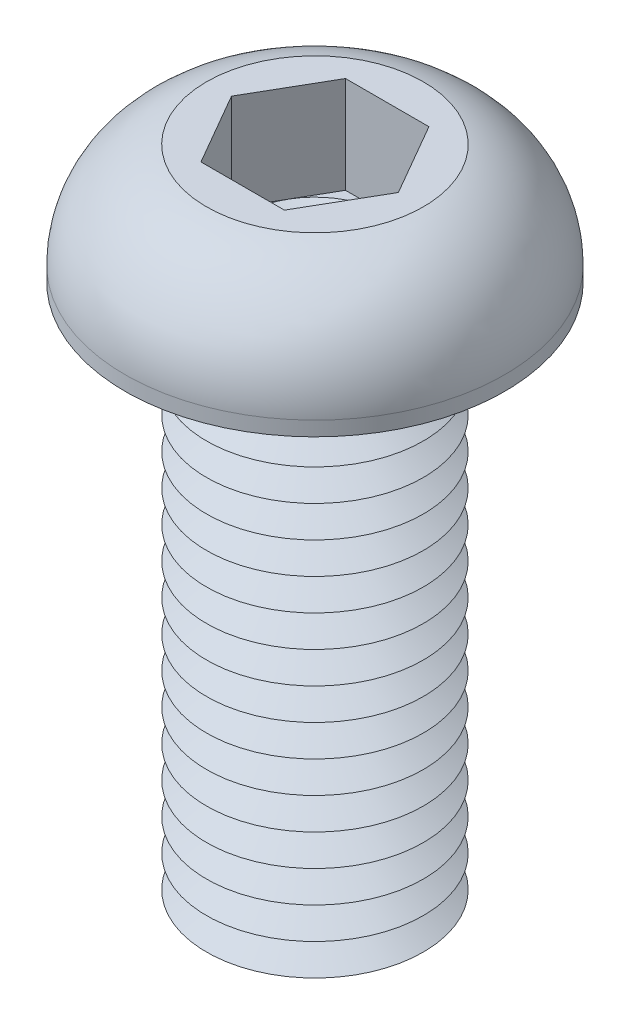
ISO-10303-21;
HEADER;
FILE_DESCRIPTION(('STEP AP214'),'2;1');
FILE_NAME('part.step','',(''),(''),'','','');
FILE_SCHEMA(('AUTOMOTIVE_DESIGN { 1 0 10303 214 1 1 1 1 }'));
ENDSEC;
DATA;
#1=APPLICATION_CONTEXT('core data for automotive mechanical design processes');
#2=APPLICATION_PROTOCOL_DEFINITION('international standard','automotive_design',2000,#1);
#3=PRODUCT_CONTEXT('',#1,'mechanical');
#4=PRODUCT('Part','Part','',(#3));
#5=PRODUCT_RELATED_PRODUCT_CATEGORY('part','',(#4));
#6=PRODUCT_DEFINITION_FORMATION('','',#4);
#7=PRODUCT_DEFINITION_CONTEXT('part definition',#1,'design');
#8=PRODUCT_DEFINITION('design','',#6,#7);
#9=PRODUCT_DEFINITION_SHAPE('','',#8);
#10=(LENGTH_UNIT() NAMED_UNIT(*) SI_UNIT(.MILLI.,.METRE.));
#11=(NAMED_UNIT(*) PLANE_ANGLE_UNIT() SI_UNIT($,.RADIAN.));
#12=(NAMED_UNIT(*) SI_UNIT($,.STERADIAN.) SOLID_ANGLE_UNIT());
#13=UNCERTAINTY_MEASURE_WITH_UNIT(LENGTH_MEASURE(1.E-05),#10,'distance_accuracy_value','');
#14=(GEOMETRIC_REPRESENTATION_CONTEXT(3) GLOBAL_UNCERTAINTY_ASSIGNED_CONTEXT((#13)) GLOBAL_UNIT_ASSIGNED_CONTEXT((#10,
#11,#12)) REPRESENTATION_CONTEXT('',''));
#15=CARTESIAN_POINT('',(0.,0.,0.));
#16=DIRECTION('',(0.,0.,1.));
#17=DIRECTION('',(1.,0.,0.));
#18=AXIS2_PLACEMENT_3D('',#15,#16,#17);
#19=CARTESIAN_POINT('',(0.,0.,0.));
#20=DIRECTION('',(0.,-1.,0.));
#21=DIRECTION('',(0.,0.,-1.));
#22=AXIS2_PLACEMENT_3D('',#19,#20,#21);
#23=TOROIDAL_SURFACE('',#22,6.875,0.875);
#24=CARTESIAN_POINT('',(0.,0.,-7.75));
#25=VERTEX_POINT('',#24);
#26=VERTEX_LOOP('',#25);
#27=FACE_BOUND('',#26,.T.);
#28=ADVANCED_FACE('P0_F12',(#27),#23,.T.);
#29=CLOSED_SHELL('',(#28));
#30=MANIFOLD_SOLID_BREP('P0_B1',#29);
#31=CARTESIAN_POINT('',(2.3094010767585,1.24,-4.));
#32=DIRECTION('',(0.,1.,0.));
#33=DIRECTION('',(0.,0.,1.));
#34=AXIS2_PLACEMENT_3D('',#31,#32,#33);
#35=PLANE('',#34);
#36=CARTESIAN_POINT('',(0.,1.24,0.));
#37=DIRECTION('',(0.,1.,0.));
#38=DIRECTION('',(0.,0.,1.));
#39=AXIS2_PLACEMENT_3D('',#36,#37,#38);
#40=CIRCLE('',#39,4.);
#41=CARTESIAN_POINT('',(0.,1.24,4.));
#42=VERTEX_POINT('',#41);
#43=CARTESIAN_POINT('',(3.46410161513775,1.24,2.));
#44=VERTEX_POINT('',#43);
#45=EDGE_CURVE('P1_E93',#42,#44,#40,.T.);
#46=ORIENTED_EDGE('',*,*,#45,.F.);
#47=DIRECTION('',(1.,0.,0.));
#48=VECTOR('',#47,1.);
#49=CARTESIAN_POINT('',(-2.3094010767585,1.24,4.));
#50=LINE('',#49,#48);
#51=CARTESIAN_POINT('',(2.3094010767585,1.24,4.));
#52=VERTEX_POINT('',#51);
#53=EDGE_CURVE('P1_E116',#42,#52,#50,.T.);
#54=ORIENTED_EDGE('',*,*,#53,.T.);
#55=DIRECTION('',(0.5,0.,-0.866025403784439));
#56=VECTOR('',#55,1.);
#57=CARTESIAN_POINT('',(2.3094010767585,1.24,4.));
#58=LINE('',#57,#56);
#59=EDGE_CURVE('P1_E112',#52,#44,#58,.T.);
#60=ORIENTED_EDGE('',*,*,#59,.T.);
#61=EDGE_LOOP('',(#46,#54,#60));
#62=FACE_BOUND('',#61,.T.);
#63=ADVANCED_FACE('P1_F15',(#62),#35,.T.);
#64=CARTESIAN_POINT('',(0.,1.24,0.));
#65=DIRECTION('',(0.,1.,0.));
#66=DIRECTION('',(0.,0.,1.));
#67=AXIS2_PLACEMENT_3D('',#64,#65,#66);
#68=CIRCLE('',#67,4.);
#69=CARTESIAN_POINT('',(3.46410161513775,1.24,-2.));
#70=VERTEX_POINT('',#69);
#71=EDGE_CURVE('P1_E10',#44,#70,#68,.T.);
#72=ORIENTED_EDGE('',*,*,#71,.F.);
#73=CARTESIAN_POINT('',(4.61880215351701,1.24,0.));
#74=VERTEX_POINT('',#73);
#75=EDGE_CURVE('P1_E104',#44,#74,#58,.T.);
#76=ORIENTED_EDGE('',*,*,#75,.T.);
#77=DIRECTION('',(-0.5,0.,-0.866025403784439));
#78=VECTOR('',#77,1.);
#79=CARTESIAN_POINT('',(4.61880215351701,1.24,0.));
#80=LINE('',#79,#78);
#81=EDGE_CURVE('P1_E107',#74,#70,#80,.T.);
#82=ORIENTED_EDGE('',*,*,#81,.T.);
#83=EDGE_LOOP('',(#72,#76,#82));
#84=FACE_BOUND('',#83,.T.);
#85=ADVANCED_FACE('P1_F103',(#84),#35,.T.);
#86=CARTESIAN_POINT('',(0.,1.24,-4.));
#87=VERTEX_POINT('',#86);
#88=EDGE_CURVE('P1_E24',#70,#87,#68,.T.);
#89=ORIENTED_EDGE('',*,*,#88,.F.);
#90=CARTESIAN_POINT('',(2.3094010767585,1.24,-4.));
#91=VERTEX_POINT('',#90);
#92=EDGE_CURVE('P1_E139',#70,#91,#80,.T.);
#93=ORIENTED_EDGE('',*,*,#92,.T.);
#94=DIRECTION('',(-1.,0.,0.));
#95=VECTOR('',#94,1.);
#96=CARTESIAN_POINT('',(2.3094010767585,1.24,-4.));
#97=LINE('',#96,#95);
#98=EDGE_CURVE('P1_E318',#91,#87,#97,.T.);
#99=ORIENTED_EDGE('',*,*,#98,.T.);
#100=EDGE_LOOP('',(#89,#93,#99));
#101=FACE_BOUND('',#100,.T.);
#102=ADVANCED_FACE('P1_F283',(#101),#35,.T.);
#103=CARTESIAN_POINT('',(-3.46410161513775,1.24,-2.));
#104=VERTEX_POINT('',#103);
#105=EDGE_CURVE('P1_E313',#87,#104,#68,.T.);
#106=ORIENTED_EDGE('',*,*,#105,.F.);
#107=CARTESIAN_POINT('',(-2.3094010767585,1.24,-4.));
#108=VERTEX_POINT('',#107);
#109=EDGE_CURVE('P1_E322',#87,#108,#97,.T.);
#110=ORIENTED_EDGE('',*,*,#109,.T.);
#111=DIRECTION('',(-0.5,0.,0.866025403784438));
#112=VECTOR('',#111,1.);
#113=CARTESIAN_POINT('',(-2.3094010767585,1.24,-4.));
#114=LINE('',#113,#112);
#115=EDGE_CURVE('P1_E317',#108,#104,#114,.T.);
#116=ORIENTED_EDGE('',*,*,#115,.T.);
#117=EDGE_LOOP('',(#106,#110,#116));
#118=FACE_BOUND('',#117,.T.);
#119=ADVANCED_FACE('P1_F297',(#118),#35,.T.);
#120=CARTESIAN_POINT('',(-3.46410161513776,1.24,2.));
#121=VERTEX_POINT('',#120);
#122=EDGE_CURVE('P1_E31',#104,#121,#68,.T.);
#123=ORIENTED_EDGE('',*,*,#122,.F.);
#124=CARTESIAN_POINT('',(-4.61880215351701,1.24,0.));
#125=VERTEX_POINT('',#124);
#126=EDGE_CURVE('P1_E309',#104,#125,#114,.T.);
#127=ORIENTED_EDGE('',*,*,#126,.T.);
#128=DIRECTION('',(0.5,0.,0.866025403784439));
#129=VECTOR('',#128,1.);
#130=CARTESIAN_POINT('',(-4.61880215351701,1.24,0.));
#131=LINE('',#130,#129);
#132=EDGE_CURVE('P1_E312',#125,#121,#131,.T.);
#133=ORIENTED_EDGE('',*,*,#132,.T.);
#134=EDGE_LOOP('',(#123,#127,#133));
#135=FACE_BOUND('',#134,.T.);
#136=ADVANCED_FACE('P1_F288',(#135),#35,.T.);
#137=CARTESIAN_POINT('',(0.,-28.25,0.));
#138=DIRECTION('',(0.,1.,0.));
#139=DIRECTION('',(0.,0.,1.));
#140=AXIS2_PLACEMENT_3D('',#137,#138,#139);
#141=CONICAL_SURFACE('',#140,4.48445554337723,1.0471975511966);
#142=CARTESIAN_POINT('',(0.,-27.375,0.));
#143=DIRECTION('',(0.,-1.,0.));
#144=DIRECTION('',(0.,0.,-1.));
#145=AXIS2_PLACEMENT_3D('',#142,#143,#144);
#146=CIRCLE('',#145,6.);
#147=CARTESIAN_POINT('',(0.,-27.375,-6.));
#148=VERTEX_POINT('',#147);
#149=EDGE_CURVE('P1_E245',#148,#148,#146,.T.);
#150=ORIENTED_EDGE('',*,*,#149,.T.);
#151=EDGE_LOOP('',(#150));
#152=FACE_BOUND('',#151,.T.);
#153=CARTESIAN_POINT('',(0.,-28.25,0.));
#154=DIRECTION('',(0.,-1.,0.));
#155=DIRECTION('',(0.,0.,-1.));
#156=AXIS2_PLACEMENT_3D('',#153,#154,#155);
#157=CIRCLE('',#156,4.48445554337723);
#158=CARTESIAN_POINT('',(0.,-28.25,-4.48445554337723));
#159=VERTEX_POINT('',#158);
#160=EDGE_CURVE('P1_E248',#159,#159,#157,.T.);
#161=ORIENTED_EDGE('',*,*,#160,.F.);
#162=EDGE_LOOP('',(#161));
#163=FACE_BOUND('',#162,.T.);
#164=ADVANCED_FACE('P1_F296',(#152,#163),#141,.T.);
#165=CARTESIAN_POINT('',(0.,-29.125,0.));
#166=DIRECTION('',(0.,-1.,0.));
#167=DIRECTION('',(0.,0.,-1.));
#168=AXIS2_PLACEMENT_3D('',#165,#166,#167);
#169=CONICAL_SURFACE('',#168,6.,1.0471975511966);
#170=ORIENTED_EDGE('',*,*,#160,.T.);
#171=EDGE_LOOP('',(#170));
#172=FACE_BOUND('',#171,.T.);
#173=CARTESIAN_POINT('',(0.,-29.125,0.));
#174=DIRECTION('',(0.,-1.,0.));
#175=DIRECTION('',(0.,0.,-1.));
#176=AXIS2_PLACEMENT_3D('',#173,#174,#175);
#177=CIRCLE('',#176,6.);
#178=CARTESIAN_POINT('',(0.,-29.125,-6.));
#179=VERTEX_POINT('',#178);
#180=EDGE_CURVE('P1_E251',#179,#179,#177,.T.);
#181=ORIENTED_EDGE('',*,*,#180,.F.);
#182=EDGE_LOOP('',(#181));
#183=FACE_BOUND('',#182,.T.);
#184=ADVANCED_FACE('P1_F303',(#172,#183),#169,.T.);
#185=CARTESIAN_POINT('',(0.,-30.,0.));
#186=DIRECTION('',(0.,1.,0.));
#187=DIRECTION('',(0.,0.,1.));
#188=AXIS2_PLACEMENT_3D('',#185,#186,#187);
#189=PLANE('',#188);
#190=CARTESIAN_POINT('',(0.,-30.,0.));
#191=DIRECTION('',(0.,-1.,0.));
#192=DIRECTION('',(0.,0.,-1.));
#193=AXIS2_PLACEMENT_3D('',#190,#191,#192);
#194=CIRCLE('',#193,4.48445554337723);
#195=CARTESIAN_POINT('',(0.,-30.,-4.48445554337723));
#196=VERTEX_POINT('',#195);
#197=EDGE_CURVE('P1_E254',#196,#196,#194,.T.);
#198=ORIENTED_EDGE('',*,*,#197,.T.);
#199=EDGE_LOOP('',(#198));
#200=FACE_BOUND('',#199,.T.);
#201=ADVANCED_FACE('P1_F381',(#200),#189,.F.);
#202=CARTESIAN_POINT('',(0.,-30.,0.));
#203=DIRECTION('',(0.,1.,0.));
#204=DIRECTION('',(0.,0.,1.));
#205=AXIS2_PLACEMENT_3D('',#202,#203,#204);
#206=CONICAL_SURFACE('',#205,4.48445554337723,1.0471975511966);
#207=ORIENTED_EDGE('',*,*,#180,.T.);
#208=EDGE_LOOP('',(#207));
#209=FACE_BOUND('',#208,.T.);
#210=ORIENTED_EDGE('',*,*,#197,.F.);
#211=EDGE_LOOP('',(#210));
#212=FACE_BOUND('',#211,.T.);
#213=ADVANCED_FACE('P1_F392',(#209,#212),#206,.T.);
#214=CARTESIAN_POINT('',(0.,-26.5,0.));
#215=DIRECTION('',(0.,1.,0.));
#216=DIRECTION('',(0.,0.,1.));
#217=AXIS2_PLACEMENT_3D('',#214,#215,#216);
#218=CONICAL_SURFACE('',#217,4.48445554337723,1.0471975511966);
#219=CARTESIAN_POINT('',(0.,-25.625,0.));
#220=DIRECTION('',(0.,-1.,0.));
#221=DIRECTION('',(0.,0.,-1.));
#222=AXIS2_PLACEMENT_3D('',#219,#220,#221);
#223=CIRCLE('',#222,6.);
#224=CARTESIAN_POINT('',(0.,-25.625,-6.));
#225=VERTEX_POINT('',#224);
#226=EDGE_CURVE('P1_E239',#225,#225,#223,.T.);
#227=ORIENTED_EDGE('',*,*,#226,.T.);
#228=EDGE_LOOP('',(#227));
#229=FACE_BOUND('',#228,.T.);
#230=CARTESIAN_POINT('',(0.,-26.5,0.));
#231=DIRECTION('',(0.,-1.,0.));
#232=DIRECTION('',(0.,0.,-1.));
#233=AXIS2_PLACEMENT_3D('',#230,#231,#232);
#234=CIRCLE('',#233,4.48445554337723);
#235=CARTESIAN_POINT('',(0.,-26.5,-4.48445554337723));
#236=VERTEX_POINT('',#235);
#237=EDGE_CURVE('P1_E242',#236,#236,#234,.T.);
#238=ORIENTED_EDGE('',*,*,#237,.F.);
#239=EDGE_LOOP('',(#238));
#240=FACE_BOUND('',#239,.T.);
#241=ADVANCED_FACE('P1_F401',(#229,#240),#218,.T.);
#242=CARTESIAN_POINT('',(0.,-27.375,0.));
#243=DIRECTION('',(0.,-1.,0.));
#244=DIRECTION('',(0.,0.,-1.));
#245=AXIS2_PLACEMENT_3D('',#242,#243,#244);
#246=CONICAL_SURFACE('',#245,6.,1.0471975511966);
#247=ORIENTED_EDGE('',*,*,#237,.T.);
#248=EDGE_LOOP('',(#247));
#249=FACE_BOUND('',#248,.T.);
#250=ORIENTED_EDGE('',*,*,#149,.F.);
#251=EDGE_LOOP('',(#250));
#252=FACE_BOUND('',#251,.T.);
#253=ADVANCED_FACE('P1_F410',(#249,#252),#246,.T.);
#254=CARTESIAN_POINT('',(0.,-24.75,0.));
#255=DIRECTION('',(0.,1.,0.));
#256=DIRECTION('',(0.,0.,1.));
#257=AXIS2_PLACEMENT_3D('',#254,#255,#256);
#258=CONICAL_SURFACE('',#257,4.48445554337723,1.0471975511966);
#259=CARTESIAN_POINT('',(0.,-23.875,0.));
#260=DIRECTION('',(0.,-1.,0.));
#261=DIRECTION('',(0.,0.,-1.));
#262=AXIS2_PLACEMENT_3D('',#259,#260,#261);
#263=CIRCLE('',#262,6.);
#264=CARTESIAN_POINT('',(0.,-23.875,-6.));
#265=VERTEX_POINT('',#264);
#266=EDGE_CURVE('P1_E233',#265,#265,#263,.T.);
#267=ORIENTED_EDGE('',*,*,#266,.T.);
#268=EDGE_LOOP('',(#267));
#269=FACE_BOUND('',#268,.T.);
#270=CARTESIAN_POINT('',(0.,-24.75,0.));
#271=DIRECTION('',(0.,-1.,0.));
#272=DIRECTION('',(0.,0.,-1.));
#273=AXIS2_PLACEMENT_3D('',#270,#271,#272);
#274=CIRCLE('',#273,4.48445554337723);
#275=CARTESIAN_POINT('',(0.,-24.75,-4.48445554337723));
#276=VERTEX_POINT('',#275);
#277=EDGE_CURVE('P1_E236',#276,#276,#274,.T.);
#278=ORIENTED_EDGE('',*,*,#277,.F.);
#279=EDGE_LOOP('',(#278));
#280=FACE_BOUND('',#279,.T.);
#281=ADVANCED_FACE('P1_F420',(#269,#280),#258,.T.);
#282=CARTESIAN_POINT('',(0.,-25.625,0.));
#283=DIRECTION('',(0.,-1.,0.));
#284=DIRECTION('',(0.,0.,-1.));
#285=AXIS2_PLACEMENT_3D('',#282,#283,#284);
#286=CONICAL_SURFACE('',#285,6.,1.0471975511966);
#287=ORIENTED_EDGE('',*,*,#277,.T.);
#288=EDGE_LOOP('',(#287));
#289=FACE_BOUND('',#288,.T.);
#290=ORIENTED_EDGE('',*,*,#226,.F.);
#291=EDGE_LOOP('',(#290));
#292=FACE_BOUND('',#291,.T.);
#293=ADVANCED_FACE('P1_F430',(#289,#292),#286,.T.);
#294=CARTESIAN_POINT('',(0.,-23.,0.));
#295=DIRECTION('',(0.,1.,0.));
#296=DIRECTION('',(0.,0.,1.));
#297=AXIS2_PLACEMENT_3D('',#294,#295,#296);
#298=CONICAL_SURFACE('',#297,4.48445554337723,1.0471975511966);
#299=CARTESIAN_POINT('',(0.,-22.125,0.));
#300=DIRECTION('',(0.,-1.,0.));
#301=DIRECTION('',(0.,0.,-1.));
#302=AXIS2_PLACEMENT_3D('',#299,#300,#301);
#303=CIRCLE('',#302,6.);
#304=CARTESIAN_POINT('',(0.,-22.125,-6.));
#305=VERTEX_POINT('',#304);
#306=EDGE_CURVE('P1_E227',#305,#305,#303,.T.);
#307=ORIENTED_EDGE('',*,*,#306,.T.);
#308=EDGE_LOOP('',(#307));
#309=FACE_BOUND('',#308,.T.);
#310=CARTESIAN_POINT('',(0.,-23.,0.));
#311=DIRECTION('',(0.,-1.,0.));
#312=DIRECTION('',(0.,0.,-1.));
#313=AXIS2_PLACEMENT_3D('',#310,#311,#312);
#314=CIRCLE('',#313,4.48445554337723);
#315=CARTESIAN_POINT('',(0.,-23.,-4.48445554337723));
#316=VERTEX_POINT('',#315);
#317=EDGE_CURVE('P1_E230',#316,#316,#314,.T.);
#318=ORIENTED_EDGE('',*,*,#317,.F.);
#319=EDGE_LOOP('',(#318));
#320=FACE_BOUND('',#319,.T.);
#321=ADVANCED_FACE('P1_F440',(#309,#320),#298,.T.);
#322=CARTESIAN_POINT('',(0.,-23.875,0.));
#323=DIRECTION('',(0.,-1.,0.));
#324=DIRECTION('',(0.,0.,-1.));
#325=AXIS2_PLACEMENT_3D('',#322,#323,#324);
#326=CONICAL_SURFACE('',#325,6.,1.0471975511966);
#327=ORIENTED_EDGE('',*,*,#317,.T.);
#328=EDGE_LOOP('',(#327));
#329=FACE_BOUND('',#328,.T.);
#330=ORIENTED_EDGE('',*,*,#266,.F.);
#331=EDGE_LOOP('',(#330));
#332=FACE_BOUND('',#331,.T.);
#333=ADVANCED_FACE('P1_F450',(#329,#332),#326,.T.);
#334=CARTESIAN_POINT('',(0.,-21.25,0.));
#335=DIRECTION('',(0.,1.,0.));
#336=DIRECTION('',(0.,0.,1.));
#337=AXIS2_PLACEMENT_3D('',#334,#335,#336);
#338=CONICAL_SURFACE('',#337,4.48445554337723,1.0471975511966);
#339=CARTESIAN_POINT('',(0.,-20.375,0.));
#340=DIRECTION('',(0.,-1.,0.));
#341=DIRECTION('',(0.,0.,-1.));
#342=AXIS2_PLACEMENT_3D('',#339,#340,#341);
#343=CIRCLE('',#342,6.);
#344=CARTESIAN_POINT('',(0.,-20.375,-6.));
#345=VERTEX_POINT('',#344);
#346=EDGE_CURVE('P1_E221',#345,#345,#343,.T.);
#347=ORIENTED_EDGE('',*,*,#346,.T.);
#348=EDGE_LOOP('',(#347));
#349=FACE_BOUND('',#348,.T.);
#350=CARTESIAN_POINT('',(0.,-21.25,0.));
#351=DIRECTION('',(0.,-1.,0.));
#352=DIRECTION('',(0.,0.,-1.));
#353=AXIS2_PLACEMENT_3D('',#350,#351,#352);
#354=CIRCLE('',#353,4.48445554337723);
#355=CARTESIAN_POINT('',(0.,-21.25,-4.48445554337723));
#356=VERTEX_POINT('',#355);
#357=EDGE_CURVE('P1_E224',#356,#356,#354,.T.);
#358=ORIENTED_EDGE('',*,*,#357,.F.);
#359=EDGE_LOOP('',(#358));
#360=FACE_BOUND('',#359,.T.);
#361=ADVANCED_FACE('P1_F460',(#349,#360),#338,.T.);
#362=CARTESIAN_POINT('',(0.,-22.125,0.));
#363=DIRECTION('',(0.,-1.,0.));
#364=DIRECTION('',(0.,0.,-1.));
#365=AXIS2_PLACEMENT_3D('',#362,#363,#364);
#366=CONICAL_SURFACE('',#365,6.,1.0471975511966);
#367=ORIENTED_EDGE('',*,*,#357,.T.);
#368=EDGE_LOOP('',(#367));
#369=FACE_BOUND('',#368,.T.);
#370=ORIENTED_EDGE('',*,*,#306,.F.);
#371=EDGE_LOOP('',(#370));
#372=FACE_BOUND('',#371,.T.);
#373=ADVANCED_FACE('P1_F470',(#369,#372),#366,.T.);
#374=CARTESIAN_POINT('',(0.,-19.5,0.));
#375=DIRECTION('',(0.,1.,0.));
#376=DIRECTION('',(0.,0.,1.));
#377=AXIS2_PLACEMENT_3D('',#374,#375,#376);
#378=CONICAL_SURFACE('',#377,4.48445554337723,1.0471975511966);
#379=CARTESIAN_POINT('',(0.,-18.625,0.));
#380=DIRECTION('',(0.,-1.,0.));
#381=DIRECTION('',(0.,0.,-1.));
#382=AXIS2_PLACEMENT_3D('',#379,#380,#381);
#383=CIRCLE('',#382,6.);
#384=CARTESIAN_POINT('',(0.,-18.625,-6.));
#385=VERTEX_POINT('',#384);
#386=EDGE_CURVE('P1_E215',#385,#385,#383,.T.);
#387=ORIENTED_EDGE('',*,*,#386,.T.);
#388=EDGE_LOOP('',(#387));
#389=FACE_BOUND('',#388,.T.);
#390=CARTESIAN_POINT('',(0.,-19.5,0.));
#391=DIRECTION('',(0.,-1.,0.));
#392=DIRECTION('',(0.,0.,-1.));
#393=AXIS2_PLACEMENT_3D('',#390,#391,#392);
#394=CIRCLE('',#393,4.48445554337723);
#395=CARTESIAN_POINT('',(0.,-19.5,-4.48445554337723));
#396=VERTEX_POINT('',#395);
#397=EDGE_CURVE('P1_E218',#396,#396,#394,.T.);
#398=ORIENTED_EDGE('',*,*,#397,.F.);
#399=EDGE_LOOP('',(#398));
#400=FACE_BOUND('',#399,.T.);
#401=ADVANCED_FACE('P1_F480',(#389,#400),#378,.T.);
#402=CARTESIAN_POINT('',(0.,-20.375,0.));
#403=DIRECTION('',(0.,-1.,0.));
#404=DIRECTION('',(0.,0.,-1.));
#405=AXIS2_PLACEMENT_3D('',#402,#403,#404);
#406=CONICAL_SURFACE('',#405,6.,1.0471975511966);
#407=ORIENTED_EDGE('',*,*,#397,.T.);
#408=EDGE_LOOP('',(#407));
#409=FACE_BOUND('',#408,.T.);
#410=ORIENTED_EDGE('',*,*,#346,.F.);
#411=EDGE_LOOP('',(#410));
#412=FACE_BOUND('',#411,.T.);
#413=ADVANCED_FACE('P1_F490',(#409,#412),#406,.T.);
#414=CARTESIAN_POINT('',(0.,-17.75,0.));
#415=DIRECTION('',(0.,1.,0.));
#416=DIRECTION('',(0.,0.,1.));
#417=AXIS2_PLACEMENT_3D('',#414,#415,#416);
#418=CONICAL_SURFACE('',#417,4.48445554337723,1.0471975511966);
#419=CARTESIAN_POINT('',(0.,-16.875,0.));
#420=DIRECTION('',(0.,-1.,0.));
#421=DIRECTION('',(0.,0.,-1.));
#422=AXIS2_PLACEMENT_3D('',#419,#420,#421);
#423=CIRCLE('',#422,6.);
#424=CARTESIAN_POINT('',(0.,-16.875,-6.));
#425=VERTEX_POINT('',#424);
#426=EDGE_CURVE('P1_E209',#425,#425,#423,.T.);
#427=ORIENTED_EDGE('',*,*,#426,.T.);
#428=EDGE_LOOP('',(#427));
#429=FACE_BOUND('',#428,.T.);
#430=CARTESIAN_POINT('',(0.,-17.75,0.));
#431=DIRECTION('',(0.,-1.,0.));
#432=DIRECTION('',(0.,0.,-1.));
#433=AXIS2_PLACEMENT_3D('',#430,#431,#432);
#434=CIRCLE('',#433,4.48445554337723);
#435=CARTESIAN_POINT('',(0.,-17.75,-4.48445554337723));
#436=VERTEX_POINT('',#435);
#437=EDGE_CURVE('P1_E212',#436,#436,#434,.T.);
#438=ORIENTED_EDGE('',*,*,#437,.F.);
#439=EDGE_LOOP('',(#438));
#440=FACE_BOUND('',#439,.T.);
#441=ADVANCED_FACE('P1_F500',(#429,#440),#418,.T.);
#442=CARTESIAN_POINT('',(0.,-18.625,0.));
#443=DIRECTION('',(0.,-1.,0.));
#444=DIRECTION('',(0.,0.,-1.));
#445=AXIS2_PLACEMENT_3D('',#442,#443,#444);
#446=CONICAL_SURFACE('',#445,6.,1.0471975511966);
#447=ORIENTED_EDGE('',*,*,#437,.T.);
#448=EDGE_LOOP('',(#447));
#449=FACE_BOUND('',#448,.T.);
#450=ORIENTED_EDGE('',*,*,#386,.F.);
#451=EDGE_LOOP('',(#450));
#452=FACE_BOUND('',#451,.T.);
#453=ADVANCED_FACE('P1_F510',(#449,#452),#446,.T.);
#454=CARTESIAN_POINT('',(0.,-16.,0.));
#455=DIRECTION('',(0.,1.,0.));
#456=DIRECTION('',(0.,0.,1.));
#457=AXIS2_PLACEMENT_3D('',#454,#455,#456);
#458=CONICAL_SURFACE('',#457,4.48445554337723,1.0471975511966);
#459=CARTESIAN_POINT('',(0.,-15.125,0.));
#460=DIRECTION('',(0.,-1.,0.));
#461=DIRECTION('',(0.,0.,-1.));
#462=AXIS2_PLACEMENT_3D('',#459,#460,#461);
#463=CIRCLE('',#462,6.);
#464=CARTESIAN_POINT('',(0.,-15.125,-6.));
#465=VERTEX_POINT('',#464);
#466=EDGE_CURVE('P1_E203',#465,#465,#463,.T.);
#467=ORIENTED_EDGE('',*,*,#466,.T.);
#468=EDGE_LOOP('',(#467));
#469=FACE_BOUND('',#468,.T.);
#470=CARTESIAN_POINT('',(0.,-16.,0.));
#471=DIRECTION('',(0.,-1.,0.));
#472=DIRECTION('',(0.,0.,-1.));
#473=AXIS2_PLACEMENT_3D('',#470,#471,#472);
#474=CIRCLE('',#473,4.48445554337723);
#475=CARTESIAN_POINT('',(0.,-16.,-4.48445554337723));
#476=VERTEX_POINT('',#475);
#477=EDGE_CURVE('P1_E206',#476,#476,#474,.T.);
#478=ORIENTED_EDGE('',*,*,#477,.F.);
#479=EDGE_LOOP('',(#478));
#480=FACE_BOUND('',#479,.T.);
#481=ADVANCED_FACE('P1_F520',(#469,#480),#458,.T.);
#482=CARTESIAN_POINT('',(0.,-16.875,0.));
#483=DIRECTION('',(0.,-1.,0.));
#484=DIRECTION('',(0.,0.,-1.));
#485=AXIS2_PLACEMENT_3D('',#482,#483,#484);
#486=CONICAL_SURFACE('',#485,6.,1.0471975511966);
#487=ORIENTED_EDGE('',*,*,#477,.T.);
#488=EDGE_LOOP('',(#487));
#489=FACE_BOUND('',#488,.T.);
#490=ORIENTED_EDGE('',*,*,#426,.F.);
#491=EDGE_LOOP('',(#490));
#492=FACE_BOUND('',#491,.T.);
#493=ADVANCED_FACE('P1_F530',(#489,#492),#486,.T.);
#494=CARTESIAN_POINT('',(0.,-14.25,0.));
#495=DIRECTION('',(0.,1.,0.));
#496=DIRECTION('',(0.,0.,1.));
#497=AXIS2_PLACEMENT_3D('',#494,#495,#496);
#498=CONICAL_SURFACE('',#497,4.48445554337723,1.0471975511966);
#499=CARTESIAN_POINT('',(0.,-13.375,0.));
#500=DIRECTION('',(0.,-1.,0.));
#501=DIRECTION('',(0.,0.,-1.));
#502=AXIS2_PLACEMENT_3D('',#499,#500,#501);
#503=CIRCLE('',#502,6.);
#504=CARTESIAN_POINT('',(0.,-13.375,-6.));
#505=VERTEX_POINT('',#504);
#506=EDGE_CURVE('P1_E197',#505,#505,#503,.T.);
#507=ORIENTED_EDGE('',*,*,#506,.T.);
#508=EDGE_LOOP('',(#507));
#509=FACE_BOUND('',#508,.T.);
#510=CARTESIAN_POINT('',(0.,-14.25,0.));
#511=DIRECTION('',(0.,-1.,0.));
#512=DIRECTION('',(0.,0.,-1.));
#513=AXIS2_PLACEMENT_3D('',#510,#511,#512);
#514=CIRCLE('',#513,4.48445554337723);
#515=CARTESIAN_POINT('',(0.,-14.25,-4.48445554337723));
#516=VERTEX_POINT('',#515);
#517=EDGE_CURVE('P1_E200',#516,#516,#514,.T.);
#518=ORIENTED_EDGE('',*,*,#517,.F.);
#519=EDGE_LOOP('',(#518));
#520=FACE_BOUND('',#519,.T.);
#521=ADVANCED_FACE('P1_F540',(#509,#520),#498,.T.);
#522=CARTESIAN_POINT('',(0.,-15.125,0.));
#523=DIRECTION('',(0.,-1.,0.));
#524=DIRECTION('',(0.,0.,-1.));
#525=AXIS2_PLACEMENT_3D('',#522,#523,#524);
#526=CONICAL_SURFACE('',#525,6.,1.0471975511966);
#527=ORIENTED_EDGE('',*,*,#517,.T.);
#528=EDGE_LOOP('',(#527));
#529=FACE_BOUND('',#528,.T.);
#530=ORIENTED_EDGE('',*,*,#466,.F.);
#531=EDGE_LOOP('',(#530));
#532=FACE_BOUND('',#531,.T.);
#533=ADVANCED_FACE('P1_F550',(#529,#532),#526,.T.);
#534=CARTESIAN_POINT('',(0.,-12.5,0.));
#535=DIRECTION('',(0.,1.,0.));
#536=DIRECTION('',(0.,0.,1.));
#537=AXIS2_PLACEMENT_3D('',#534,#535,#536);
#538=CONICAL_SURFACE('',#537,4.48445554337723,1.0471975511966);
#539=CARTESIAN_POINT('',(0.,-11.625,0.));
#540=DIRECTION('',(0.,-1.,0.));
#541=DIRECTION('',(0.,0.,-1.));
#542=AXIS2_PLACEMENT_3D('',#539,#540,#541);
#543=CIRCLE('',#542,6.);
#544=CARTESIAN_POINT('',(0.,-11.625,-6.));
#545=VERTEX_POINT('',#544);
#546=EDGE_CURVE('P1_E191',#545,#545,#543,.T.);
#547=ORIENTED_EDGE('',*,*,#546,.T.);
#548=EDGE_LOOP('',(#547));
#549=FACE_BOUND('',#548,.T.);
#550=CARTESIAN_POINT('',(0.,-12.5,0.));
#551=DIRECTION('',(0.,-1.,0.));
#552=DIRECTION('',(0.,0.,-1.));
#553=AXIS2_PLACEMENT_3D('',#550,#551,#552);
#554=CIRCLE('',#553,4.48445554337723);
#555=CARTESIAN_POINT('',(0.,-12.5,-4.48445554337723));
#556=VERTEX_POINT('',#555);
#557=EDGE_CURVE('P1_E194',#556,#556,#554,.T.);
#558=ORIENTED_EDGE('',*,*,#557,.F.);
#559=EDGE_LOOP('',(#558));
#560=FACE_BOUND('',#559,.T.);
#561=ADVANCED_FACE('P1_F560',(#549,#560),#538,.T.);
#562=CARTESIAN_POINT('',(0.,-13.375,0.));
#563=DIRECTION('',(0.,-1.,0.));
#564=DIRECTION('',(0.,0.,-1.));
#565=AXIS2_PLACEMENT_3D('',#562,#563,#564);
#566=CONICAL_SURFACE('',#565,6.,1.0471975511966);
#567=ORIENTED_EDGE('',*,*,#557,.T.);
#568=EDGE_LOOP('',(#567));
#569=FACE_BOUND('',#568,.T.);
#570=ORIENTED_EDGE('',*,*,#506,.F.);
#571=EDGE_LOOP('',(#570));
#572=FACE_BOUND('',#571,.T.);
#573=ADVANCED_FACE('P1_F570',(#569,#572),#566,.T.);
#574=CARTESIAN_POINT('',(0.,-10.75,0.));
#575=DIRECTION('',(0.,1.,0.));
#576=DIRECTION('',(0.,0.,1.));
#577=AXIS2_PLACEMENT_3D('',#574,#575,#576);
#578=CONICAL_SURFACE('',#577,4.48445554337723,1.0471975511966);
#579=CARTESIAN_POINT('',(0.,-9.875,0.));
#580=DIRECTION('',(0.,-1.,0.));
#581=DIRECTION('',(0.,0.,-1.));
#582=AXIS2_PLACEMENT_3D('',#579,#580,#581);
#583=CIRCLE('',#582,6.);
#584=CARTESIAN_POINT('',(0.,-9.875,-6.));
#585=VERTEX_POINT('',#584);
#586=EDGE_CURVE('P1_E185',#585,#585,#583,.T.);
#587=ORIENTED_EDGE('',*,*,#586,.T.);
#588=EDGE_LOOP('',(#587));
#589=FACE_BOUND('',#588,.T.);
#590=CARTESIAN_POINT('',(0.,-10.75,0.));
#591=DIRECTION('',(0.,-1.,0.));
#592=DIRECTION('',(0.,0.,-1.));
#593=AXIS2_PLACEMENT_3D('',#590,#591,#592);
#594=CIRCLE('',#593,4.48445554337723);
#595=CARTESIAN_POINT('',(0.,-10.75,-4.48445554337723));
#596=VERTEX_POINT('',#595);
#597=EDGE_CURVE('P1_E188',#596,#596,#594,.T.);
#598=ORIENTED_EDGE('',*,*,#597,.F.);
#599=EDGE_LOOP('',(#598));
#600=FACE_BOUND('',#599,.T.);
#601=ADVANCED_FACE('P1_F580',(#589,#600),#578,.T.);
#602=CARTESIAN_POINT('',(0.,-11.625,0.));
#603=DIRECTION('',(0.,-1.,0.));
#604=DIRECTION('',(0.,0.,-1.));
#605=AXIS2_PLACEMENT_3D('',#602,#603,#604);
#606=CONICAL_SURFACE('',#605,6.,1.0471975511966);
#607=ORIENTED_EDGE('',*,*,#597,.T.);
#608=EDGE_LOOP('',(#607));
#609=FACE_BOUND('',#608,.T.);
#610=ORIENTED_EDGE('',*,*,#546,.F.);
#611=EDGE_LOOP('',(#610));
#612=FACE_BOUND('',#611,.T.);
#613=ADVANCED_FACE('P1_F590',(#609,#612),#606,.T.);
#614=CARTESIAN_POINT('',(0.,-9.,0.));
#615=DIRECTION('',(0.,1.,0.));
#616=DIRECTION('',(0.,0.,1.));
#617=AXIS2_PLACEMENT_3D('',#614,#615,#616);
#618=CONICAL_SURFACE('',#617,4.48445554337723,1.0471975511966);
#619=CARTESIAN_POINT('',(0.,-8.125,0.));
#620=DIRECTION('',(0.,-1.,0.));
#621=DIRECTION('',(0.,0.,-1.));
#622=AXIS2_PLACEMENT_3D('',#619,#620,#621);
#623=CIRCLE('',#622,6.);
#624=CARTESIAN_POINT('',(0.,-8.125,-6.));
#625=VERTEX_POINT('',#624);
#626=EDGE_CURVE('P1_E179',#625,#625,#623,.T.);
#627=ORIENTED_EDGE('',*,*,#626,.T.);
#628=EDGE_LOOP('',(#627));
#629=FACE_BOUND('',#628,.T.);
#630=CARTESIAN_POINT('',(0.,-9.,0.));
#631=DIRECTION('',(0.,-1.,0.));
#632=DIRECTION('',(0.,0.,-1.));
#633=AXIS2_PLACEMENT_3D('',#630,#631,#632);
#634=CIRCLE('',#633,4.48445554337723);
#635=CARTESIAN_POINT('',(0.,-9.,-4.48445554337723));
#636=VERTEX_POINT('',#635);
#637=EDGE_CURVE('P1_E182',#636,#636,#634,.T.);
#638=ORIENTED_EDGE('',*,*,#637,.F.);
#639=EDGE_LOOP('',(#638));
#640=FACE_BOUND('',#639,.T.);
#641=ADVANCED_FACE('P1_F600',(#629,#640),#618,.T.);
#642=CARTESIAN_POINT('',(0.,-9.875,0.));
#643=DIRECTION('',(0.,-1.,0.));
#644=DIRECTION('',(0.,0.,-1.));
#645=AXIS2_PLACEMENT_3D('',#642,#643,#644);
#646=CONICAL_SURFACE('',#645,6.,1.0471975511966);
#647=ORIENTED_EDGE('',*,*,#637,.T.);
#648=EDGE_LOOP('',(#647));
#649=FACE_BOUND('',#648,.T.);
#650=ORIENTED_EDGE('',*,*,#586,.F.);
#651=EDGE_LOOP('',(#650));
#652=FACE_BOUND('',#651,.T.);
#653=ADVANCED_FACE('P1_F610',(#649,#652),#646,.T.);
#654=CARTESIAN_POINT('',(0.,-7.25,0.));
#655=DIRECTION('',(0.,1.,0.));
#656=DIRECTION('',(0.,0.,1.));
#657=AXIS2_PLACEMENT_3D('',#654,#655,#656);
#658=CONICAL_SURFACE('',#657,4.48445554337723,1.0471975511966);
#659=CARTESIAN_POINT('',(0.,-6.375,0.));
#660=DIRECTION('',(0.,-1.,0.));
#661=DIRECTION('',(0.,0.,-1.));
#662=AXIS2_PLACEMENT_3D('',#659,#660,#661);
#663=CIRCLE('',#662,6.);
#664=CARTESIAN_POINT('',(0.,-6.375,-6.));
#665=VERTEX_POINT('',#664);
#666=EDGE_CURVE('P1_E173',#665,#665,#663,.T.);
#667=ORIENTED_EDGE('',*,*,#666,.T.);
#668=EDGE_LOOP('',(#667));
#669=FACE_BOUND('',#668,.T.);
#670=CARTESIAN_POINT('',(0.,-7.25,0.));
#671=DIRECTION('',(0.,-1.,0.));
#672=DIRECTION('',(0.,0.,-1.));
#673=AXIS2_PLACEMENT_3D('',#670,#671,#672);
#674=CIRCLE('',#673,4.48445554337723);
#675=CARTESIAN_POINT('',(0.,-7.25,-4.48445554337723));
#676=VERTEX_POINT('',#675);
#677=EDGE_CURVE('P1_E176',#676,#676,#674,.T.);
#678=ORIENTED_EDGE('',*,*,#677,.F.);
#679=EDGE_LOOP('',(#678));
#680=FACE_BOUND('',#679,.T.);
#681=ADVANCED_FACE('P1_F620',(#669,#680),#658,.T.);
#682=CARTESIAN_POINT('',(0.,-8.125,0.));
#683=DIRECTION('',(0.,-1.,0.));
#684=DIRECTION('',(0.,0.,-1.));
#685=AXIS2_PLACEMENT_3D('',#682,#683,#684);
#686=CONICAL_SURFACE('',#685,6.,1.0471975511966);
#687=ORIENTED_EDGE('',*,*,#677,.T.);
#688=EDGE_LOOP('',(#687));
#689=FACE_BOUND('',#688,.T.);
#690=ORIENTED_EDGE('',*,*,#626,.F.);
#691=EDGE_LOOP('',(#690));
#692=FACE_BOUND('',#691,.T.);
#693=ADVANCED_FACE('P1_F630',(#689,#692),#686,.T.);
#694=CARTESIAN_POINT('',(0.,-5.5,0.));
#695=DIRECTION('',(0.,1.,0.));
#696=DIRECTION('',(0.,0.,1.));
#697=AXIS2_PLACEMENT_3D('',#694,#695,#696);
#698=CONICAL_SURFACE('',#697,4.48445554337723,1.0471975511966);
#699=CARTESIAN_POINT('',(0.,-4.625,0.));
#700=DIRECTION('',(0.,-1.,0.));
#701=DIRECTION('',(0.,0.,-1.));
#702=AXIS2_PLACEMENT_3D('',#699,#700,#701);
#703=CIRCLE('',#702,6.);
#704=CARTESIAN_POINT('',(0.,-4.625,-6.));
#705=VERTEX_POINT('',#704);
#706=EDGE_CURVE('P1_E164',#705,#705,#703,.T.);
#707=ORIENTED_EDGE('',*,*,#706,.T.);
#708=EDGE_LOOP('',(#707));
#709=FACE_BOUND('',#708,.T.);
#710=CARTESIAN_POINT('',(0.,-5.5,0.));
#711=DIRECTION('',(0.,-1.,0.));
#712=DIRECTION('',(0.,0.,-1.));
#713=AXIS2_PLACEMENT_3D('',#710,#711,#712);
#714=CIRCLE('',#713,4.48445554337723);
#715=CARTESIAN_POINT('',(0.,-5.5,-4.48445554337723));
#716=VERTEX_POINT('',#715);
#717=EDGE_CURVE('P1_E170',#716,#716,#714,.T.);
#718=ORIENTED_EDGE('',*,*,#717,.F.);
#719=EDGE_LOOP('',(#718));
#720=FACE_BOUND('',#719,.T.);
#721=ADVANCED_FACE('P1_F640',(#709,#720),#698,.T.);
#722=CARTESIAN_POINT('',(0.,-6.375,0.));
#723=DIRECTION('',(0.,-1.,0.));
#724=DIRECTION('',(0.,0.,-1.));
#725=AXIS2_PLACEMENT_3D('',#722,#723,#724);
#726=CONICAL_SURFACE('',#725,6.,1.0471975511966);
#727=ORIENTED_EDGE('',*,*,#717,.T.);
#728=EDGE_LOOP('',(#727));
#729=FACE_BOUND('',#728,.T.);
#730=ORIENTED_EDGE('',*,*,#666,.F.);
#731=EDGE_LOOP('',(#730));
#732=FACE_BOUND('',#731,.T.);
#733=ADVANCED_FACE('P1_F650',(#729,#732),#726,.T.);
#734=CARTESIAN_POINT('',(0.,-3.75,0.));
#735=DIRECTION('',(0.,1.,0.));
#736=DIRECTION('',(0.,0.,1.));
#737=AXIS2_PLACEMENT_3D('',#734,#735,#736);
#738=CONICAL_SURFACE('',#737,4.48445554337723,1.0471975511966);
#739=CARTESIAN_POINT('',(0.,-2.875,0.));
#740=DIRECTION('',(0.,-1.,0.));
#741=DIRECTION('',(0.,0.,-1.));
#742=AXIS2_PLACEMENT_3D('',#739,#740,#741);
#743=CIRCLE('',#742,6.);
#744=CARTESIAN_POINT('',(0.,-2.875,-6.));
#745=VERTEX_POINT('',#744);
#746=EDGE_CURVE('P1_E167',#745,#745,#743,.T.);
#747=ORIENTED_EDGE('',*,*,#746,.T.);
#748=EDGE_LOOP('',(#747));
#749=FACE_BOUND('',#748,.T.);
#750=CARTESIAN_POINT('',(0.,-3.75,0.));
#751=DIRECTION('',(0.,-1.,0.));
#752=DIRECTION('',(0.,0.,-1.));
#753=AXIS2_PLACEMENT_3D('',#750,#751,#752);
#754=CIRCLE('',#753,4.48445554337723);
#755=CARTESIAN_POINT('',(0.,-3.75,-4.48445554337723));
#756=VERTEX_POINT('',#755);
#757=EDGE_CURVE('P1_E161',#756,#756,#754,.T.);
#758=ORIENTED_EDGE('',*,*,#757,.F.);
#759=EDGE_LOOP('',(#758));
#760=FACE_BOUND('',#759,.T.);
#761=ADVANCED_FACE('P1_F660',(#749,#760),#738,.T.);
#762=CARTESIAN_POINT('',(0.,-4.625,0.));
#763=DIRECTION('',(0.,-1.,0.));
#764=DIRECTION('',(0.,0.,-1.));
#765=AXIS2_PLACEMENT_3D('',#762,#763,#764);
#766=CONICAL_SURFACE('',#765,6.,1.0471975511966);
#767=ORIENTED_EDGE('',*,*,#757,.T.);
#768=EDGE_LOOP('',(#767));
#769=FACE_BOUND('',#768,.T.);
#770=ORIENTED_EDGE('',*,*,#706,.F.);
#771=EDGE_LOOP('',(#770));
#772=FACE_BOUND('',#771,.T.);
#773=ADVANCED_FACE('P1_F670',(#769,#772),#766,.T.);
#774=CARTESIAN_POINT('',(0.,-30.,0.));
#775=DIRECTION('',(0.,1.,0.));
#776=DIRECTION('',(0.,0.,1.));
#777=AXIS2_PLACEMENT_3D('',#774,#775,#776);
#778=CYLINDRICAL_SURFACE('',#777,6.);
#779=CARTESIAN_POINT('',(0.,0.,0.));
#780=DIRECTION('',(0.,-1.,0.));
#781=DIRECTION('',(1.,0.,0.));
#782=AXIS2_PLACEMENT_3D('',#779,#780,#781);
#783=CIRCLE('',#782,6.);
#784=CARTESIAN_POINT('',(6.,0.,0.));
#785=VERTEX_POINT('',#784);
#786=EDGE_CURVE('P1_E141',#785,#785,#783,.F.);
#787=ORIENTED_EDGE('',*,*,#786,.F.);
#788=EDGE_LOOP('',(#787));
#789=FACE_BOUND('',#788,.T.);
#790=ORIENTED_EDGE('',*,*,#746,.F.);
#791=EDGE_LOOP('',(#790));
#792=FACE_BOUND('',#791,.T.);
#793=ADVANCED_FACE('P1_F17',(#789,#792),#778,.T.);
#794=CARTESIAN_POINT('',(0.,0.,0.));
#795=DIRECTION('',(0.,-1.,0.));
#796=DIRECTION('',(0.,0.,-1.));
#797=AXIS2_PLACEMENT_3D('',#794,#795,#796);
#798=TOROIDAL_SURFACE('',#797,6.875,0.875);
#799=ORIENTED_EDGE('',*,*,#786,.T.);
#800=EDGE_LOOP('',(#799));
#801=FACE_BOUND('',#800,.T.);
#802=CARTESIAN_POINT('',(0.,0.,0.));
#803=DIRECTION('',(0.,1.,0.));
#804=DIRECTION('',(-1.,0.,0.));
#805=AXIS2_PLACEMENT_3D('',#802,#803,#804);
#806=CIRCLE('',#805,7.75);
#807=CARTESIAN_POINT('',(-7.75,0.,0.));
#808=VERTEX_POINT('',#807);
#809=EDGE_CURVE('P1_E151',#808,#808,#806,.F.);
#810=ORIENTED_EDGE('',*,*,#809,.T.);
#811=EDGE_LOOP('',(#810));
#812=FACE_BOUND('',#811,.T.);
#813=ADVANCED_FACE('P1_F259',(#801,#812),#798,.F.);
#814=CARTESIAN_POINT('',(6.,6.6,0.));
#815=DIRECTION('',(0.,-1.,0.));
#816=DIRECTION('',(1.,0.,0.));
#817=AXIS2_PLACEMENT_3D('',#814,#815,#816);
#818=PLANE('',#817);
#819=DIRECTION('',(-1.,0.,0.));
#820=VECTOR('',#819,1.);
#821=CARTESIAN_POINT('',(2.3094010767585,6.6,-4.));
#822=LINE('',#821,#820);
#823=CARTESIAN_POINT('',(2.3094010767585,6.6,-4.));
#824=VERTEX_POINT('',#823);
#825=CARTESIAN_POINT('',(-2.3094010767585,6.6,-4.));
#826=VERTEX_POINT('',#825);
#827=EDGE_CURVE('P1_E125',#824,#826,#822,.T.);
#828=ORIENTED_EDGE('',*,*,#827,.F.);
#829=DIRECTION('',(-0.5,0.,-0.866025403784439));
#830=VECTOR('',#829,1.);
#831=CARTESIAN_POINT('',(4.61880215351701,6.6,0.));
#832=LINE('',#831,#830);
#833=CARTESIAN_POINT('',(4.61880215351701,6.6,0.));
#834=VERTEX_POINT('',#833);
#835=EDGE_CURVE('P1_E39',#834,#824,#832,.T.);
#836=ORIENTED_EDGE('',*,*,#835,.F.);
#837=DIRECTION('',(0.5,0.,-0.866025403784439));
#838=VECTOR('',#837,1.);
#839=CARTESIAN_POINT('',(2.3094010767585,6.6,4.));
#840=LINE('',#839,#838);
#841=CARTESIAN_POINT('',(2.3094010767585,6.6,4.));
#842=VERTEX_POINT('',#841);
#843=EDGE_CURVE('P1_E137',#842,#834,#840,.T.);
#844=ORIENTED_EDGE('',*,*,#843,.F.);
#845=DIRECTION('',(1.,0.,0.));
#846=VECTOR('',#845,1.);
#847=CARTESIAN_POINT('',(-2.3094010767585,6.6,4.));
#848=LINE('',#847,#846);
#849=CARTESIAN_POINT('',(-2.3094010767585,6.6,4.));
#850=VERTEX_POINT('',#849);
#851=EDGE_CURVE('P1_E134',#850,#842,#848,.T.);
#852=ORIENTED_EDGE('',*,*,#851,.F.);
#853=DIRECTION('',(0.5,0.,0.866025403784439));
#854=VECTOR('',#853,1.);
#855=CARTESIAN_POINT('',(-4.61880215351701,6.6,0.));
#856=LINE('',#855,#854);
#857=CARTESIAN_POINT('',(-4.61880215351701,6.6,0.));
#858=VERTEX_POINT('',#857);
#859=EDGE_CURVE('P1_E131',#858,#850,#856,.T.);
#860=ORIENTED_EDGE('',*,*,#859,.F.);
#861=DIRECTION('',(-0.5,0.,0.866025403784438));
#862=VECTOR('',#861,1.);
#863=CARTESIAN_POINT('',(-2.3094010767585,6.6,-4.));
#864=LINE('',#863,#862);
#865=EDGE_CURVE('P1_E128',#826,#858,#864,.T.);
#866=ORIENTED_EDGE('',*,*,#865,.F.);
#867=EDGE_LOOP('',(#828,#836,#844,#852,#860,#866));
#868=FACE_BOUND('',#867,.T.);
#869=CARTESIAN_POINT('',(0.,6.6,0.));
#870=DIRECTION('',(0.,1.,0.));
#871=DIRECTION('',(-1.,0.,0.));
#872=AXIS2_PLACEMENT_3D('',#869,#870,#871);
#873=CIRCLE('',#872,6.);
#874=CARTESIAN_POINT('',(-6.,6.6,0.));
#875=VERTEX_POINT('',#874);
#876=EDGE_CURVE('P1_E152',#875,#875,#873,.T.);
#877=ORIENTED_EDGE('',*,*,#876,.T.);
#878=EDGE_LOOP('',(#877));
#879=FACE_BOUND('',#878,.T.);
#880=ADVANCED_FACE('P1_F337',(#868,#879),#818,.F.);
#881=CARTESIAN_POINT('',(0.,0.8,0.));
#882=DIRECTION('',(0.,1.,0.));
#883=DIRECTION('',(-1.,0.,0.));
#884=AXIS2_PLACEMENT_3D('',#881,#882,#883);
#885=DEGENERATE_TOROIDAL_SURFACE('',#884,4.51222222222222,5.98777777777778,.T.);
#886=ORIENTED_EDGE('',*,*,#876,.F.);
#887=EDGE_LOOP('',(#886));
#888=FACE_BOUND('',#887,.T.);
#889=CARTESIAN_POINT('',(0.,0.799999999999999,0.));
#890=DIRECTION('',(0.,1.,0.));
#891=DIRECTION('',(-1.,0.,0.));
#892=AXIS2_PLACEMENT_3D('',#889,#890,#891);
#893=CIRCLE('',#892,10.5);
#894=CARTESIAN_POINT('',(-10.5,0.799999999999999,0.));
#895=VERTEX_POINT('',#894);
#896=EDGE_CURVE('P1_E155',#895,#895,#893,.T.);
#897=ORIENTED_EDGE('',*,*,#896,.T.);
#898=EDGE_LOOP('',(#897));
#899=FACE_BOUND('',#898,.T.);
#900=ADVANCED_FACE('P1_F273',(#888,#899),#885,.T.);
#901=CARTESIAN_POINT('',(0.,6.6,0.));
#902=DIRECTION('',(0.,1.,0.));
#903=DIRECTION('',(-1.,0.,0.));
#904=AXIS2_PLACEMENT_3D('',#901,#902,#903);
#905=CYLINDRICAL_SURFACE('',#904,10.5);
#906=ORIENTED_EDGE('',*,*,#896,.F.);
#907=EDGE_LOOP('',(#906));
#908=FACE_BOUND('',#907,.T.);
#909=CARTESIAN_POINT('',(0.,0.,0.));
#910=DIRECTION('',(0.,1.,0.));
#911=DIRECTION('',(-1.,0.,0.));
#912=AXIS2_PLACEMENT_3D('',#909,#910,#911);
#913=CIRCLE('',#912,10.5);
#914=CARTESIAN_POINT('',(-10.5,0.,0.));
#915=VERTEX_POINT('',#914);
#916=EDGE_CURVE('P1_E158',#915,#915,#913,.T.);
#917=ORIENTED_EDGE('',*,*,#916,.T.);
#918=EDGE_LOOP('',(#917));
#919=FACE_BOUND('',#918,.T.);
#920=ADVANCED_FACE('P1_F264',(#908,#919),#905,.T.);
#921=CARTESIAN_POINT('',(0.,0.,0.));
#922=DIRECTION('',(0.,1.,0.));
#923=DIRECTION('',(-1.,0.,0.));
#924=AXIS2_PLACEMENT_3D('',#921,#922,#923);
#925=PLANE('',#924);
#926=ORIENTED_EDGE('',*,*,#916,.F.);
#927=EDGE_LOOP('',(#926));
#928=FACE_BOUND('',#927,.T.);
#929=ORIENTED_EDGE('',*,*,#809,.F.);
#930=EDGE_LOOP('',(#929));
#931=FACE_BOUND('',#930,.T.);
#932=ADVANCED_FACE('P1_F261',(#928,#931),#925,.F.);
#933=CARTESIAN_POINT('',(4.61880215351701,1.24,0.));
#934=DIRECTION('',(0.866025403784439,0.,-0.5));
#935=DIRECTION('',(-0.5,0.,-0.866025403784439));
#936=AXIS2_PLACEMENT_3D('',#933,#934,#935);
#937=PLANE('',#936);
#938=ORIENTED_EDGE('',*,*,#835,.T.);
#939=DIRECTION('',(0.,1.,0.));
#940=VECTOR('',#939,1.);
#941=CARTESIAN_POINT('',(2.3094010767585,1.24,-4.));
#942=LINE('',#941,#940);
#943=EDGE_CURVE('P1_E118',#91,#824,#942,.T.);
#944=ORIENTED_EDGE('',*,*,#943,.F.);
#945=ORIENTED_EDGE('',*,*,#92,.F.);
#946=ORIENTED_EDGE('',*,*,#81,.F.);
#947=DIRECTION('',(0.,1.,0.));
#948=VECTOR('',#947,1.);
#949=CARTESIAN_POINT('',(4.61880215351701,1.24,0.));
#950=LINE('',#949,#948);
#951=EDGE_CURVE('P1_E113',#74,#834,#950,.T.);
#952=ORIENTED_EDGE('',*,*,#951,.T.);
#953=EDGE_LOOP('',(#938,#944,#945,#946,#952));
#954=FACE_BOUND('',#953,.T.);
#955=ADVANCED_FACE('P1_F263',(#954),#937,.F.);
#956=CARTESIAN_POINT('',(2.3094010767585,1.24,4.));
#957=DIRECTION('',(0.866025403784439,0.,0.5));
#958=DIRECTION('',(0.5,0.,-0.866025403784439));
#959=AXIS2_PLACEMENT_3D('',#956,#957,#958);
#960=PLANE('',#959);
#961=ORIENTED_EDGE('',*,*,#843,.T.);
#962=ORIENTED_EDGE('',*,*,#951,.F.);
#963=ORIENTED_EDGE('',*,*,#75,.F.);
#964=ORIENTED_EDGE('',*,*,#59,.F.);
#965=DIRECTION('',(0.,1.,0.));
#966=VECTOR('',#965,1.);
#967=CARTESIAN_POINT('',(2.3094010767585,1.24,4.));
#968=LINE('',#967,#966);
#969=EDGE_CURVE('P1_E142',#52,#842,#968,.T.);
#970=ORIENTED_EDGE('',*,*,#969,.T.);
#971=EDGE_LOOP('',(#961,#962,#963,#964,#970));
#972=FACE_BOUND('',#971,.T.);
#973=ADVANCED_FACE('P1_F111',(#972),#960,.F.);
#974=CARTESIAN_POINT('',(-2.3094010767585,1.24,4.));
#975=DIRECTION('',(0.,0.,1.));
#976=DIRECTION('',(1.,0.,0.));
#977=AXIS2_PLACEMENT_3D('',#974,#975,#976);
#978=PLANE('',#977);
#979=ORIENTED_EDGE('',*,*,#851,.T.);
#980=ORIENTED_EDGE('',*,*,#969,.F.);
#981=ORIENTED_EDGE('',*,*,#53,.F.);
#982=CARTESIAN_POINT('',(-2.3094010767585,1.24,4.));
#983=VERTEX_POINT('',#982);
#984=EDGE_CURVE('P1_E114',#983,#42,#50,.T.);
#985=ORIENTED_EDGE('',*,*,#984,.F.);
#986=DIRECTION('',(0.,1.,0.));
#987=VECTOR('',#986,1.);
#988=CARTESIAN_POINT('',(-2.3094010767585,1.24,4.));
#989=LINE('',#988,#987);
#990=EDGE_CURVE('P1_E144',#983,#850,#989,.T.);
#991=ORIENTED_EDGE('',*,*,#990,.T.);
#992=EDGE_LOOP('',(#979,#980,#981,#985,#991));
#993=FACE_BOUND('',#992,.T.);
#994=ADVANCED_FACE('P1_F332',(#993),#978,.F.);
#995=CARTESIAN_POINT('',(-4.61880215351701,1.24,0.));
#996=DIRECTION('',(-0.866025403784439,0.,0.5));
#997=DIRECTION('',(0.5,0.,0.866025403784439));
#998=AXIS2_PLACEMENT_3D('',#995,#996,#997);
#999=PLANE('',#998);
#1000=ORIENTED_EDGE('',*,*,#859,.T.);
#1001=ORIENTED_EDGE('',*,*,#990,.F.);
#1002=EDGE_CURVE('P1_E324',#121,#983,#131,.T.);
#1003=ORIENTED_EDGE('',*,*,#1002,.F.);
#1004=ORIENTED_EDGE('',*,*,#132,.F.);
#1005=DIRECTION('',(0.,1.,0.));
#1006=VECTOR('',#1005,1.);
#1007=CARTESIAN_POINT('',(-4.61880215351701,1.24,0.));
#1008=LINE('',#1007,#1006);
#1009=EDGE_CURVE('P1_E146',#125,#858,#1008,.T.);
#1010=ORIENTED_EDGE('',*,*,#1009,.T.);
#1011=EDGE_LOOP('',(#1000,#1001,#1003,#1004,#1010));
#1012=FACE_BOUND('',#1011,.T.);
#1013=ADVANCED_FACE('P1_F748',(#1012),#999,.F.);
#1014=CARTESIAN_POINT('',(-2.3094010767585,1.24,-4.));
#1015=DIRECTION('',(-0.866025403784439,0.,-0.5));
#1016=DIRECTION('',(-0.5,0.,0.866025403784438));
#1017=AXIS2_PLACEMENT_3D('',#1014,#1015,#1016);
#1018=PLANE('',#1017);
#1019=ORIENTED_EDGE('',*,*,#865,.T.);
#1020=ORIENTED_EDGE('',*,*,#1009,.F.);
#1021=ORIENTED_EDGE('',*,*,#126,.F.);
#1022=ORIENTED_EDGE('',*,*,#115,.F.);
#1023=DIRECTION('',(0.,1.,0.));
#1024=VECTOR('',#1023,1.);
#1025=CARTESIAN_POINT('',(-2.3094010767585,1.24,-4.));
#1026=LINE('',#1025,#1024);
#1027=EDGE_CURVE('P1_E119',#108,#826,#1026,.T.);
#1028=ORIENTED_EDGE('',*,*,#1027,.T.);
#1029=EDGE_LOOP('',(#1019,#1020,#1021,#1022,#1028));
#1030=FACE_BOUND('',#1029,.T.);
#1031=ADVANCED_FACE('P1_F292',(#1030),#1018,.F.);
#1032=CARTESIAN_POINT('',(2.3094010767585,1.24,-4.));
#1033=DIRECTION('',(0.,0.,-1.));
#1034=DIRECTION('',(-1.,0.,0.));
#1035=AXIS2_PLACEMENT_3D('',#1032,#1033,#1034);
#1036=PLANE('',#1035);
#1037=ORIENTED_EDGE('',*,*,#827,.T.);
#1038=ORIENTED_EDGE('',*,*,#1027,.F.);
#1039=ORIENTED_EDGE('',*,*,#109,.F.);
#1040=ORIENTED_EDGE('',*,*,#98,.F.);
#1041=ORIENTED_EDGE('',*,*,#943,.T.);
#1042=EDGE_LOOP('',(#1037,#1038,#1039,#1040,#1041));
#1043=FACE_BOUND('',#1042,.T.);
#1044=ADVANCED_FACE('P1_F286',(#1043),#1036,.F.);
#1045=EDGE_CURVE('P1_E19',#121,#42,#68,.T.);
#1046=ORIENTED_EDGE('',*,*,#1045,.F.);
#1047=ORIENTED_EDGE('',*,*,#1002,.T.);
#1048=ORIENTED_EDGE('',*,*,#984,.T.);
#1049=EDGE_LOOP('',(#1046,#1047,#1048));
#1050=FACE_BOUND('',#1049,.T.);
#1051=ADVANCED_FACE('P1_F90',(#1050),#35,.T.);
#1052=CARTESIAN_POINT('',(0.,1.24,0.));
#1053=DIRECTION('',(0.,1.,0.));
#1054=DIRECTION('',(0.,0.,1.));
#1055=AXIS2_PLACEMENT_3D('',#1052,#1053,#1054);
#1056=CONICAL_SURFACE('',#1055,4.,1.0471975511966);
#1057=CARTESIAN_POINT('',(0.,-1.06940107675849,0.));
#1058=VERTEX_POINT('',#1057);
#1059=VERTEX_LOOP('',#1058);
#1060=FACE_BOUND('',#1059,.T.);
#1061=ORIENTED_EDGE('',*,*,#45,.T.);
#1062=ORIENTED_EDGE('',*,*,#71,.T.);
#1063=ORIENTED_EDGE('',*,*,#88,.T.);
#1064=ORIENTED_EDGE('',*,*,#105,.T.);
#1065=ORIENTED_EDGE('',*,*,#122,.T.);
#1066=ORIENTED_EDGE('',*,*,#1045,.T.);
#1067=EDGE_LOOP('',(#1061,#1062,#1063,#1064,#1065,#1066));
#1068=FACE_BOUND('',#1067,.T.);
#1069=ADVANCED_FACE('P1_F88',(#1060,#1068),#1056,.F.);
#1070=CLOSED_SHELL('',(#63,#85,#102,#119,#136,#164,#184,#201,#213,#241,#253,#281,#293,#321,#333,
#361,#373,#401,#413,#441,#453,#481,#493,#521,#533,#561,#573,#601,#613,#641,#653,#681,#693,#721,
#733,#761,#773,#793,#813,#880,#900,#920,#932,#955,#973,#994,#1013,#1031,#1044,#1051,#1069));
#1071=MANIFOLD_SOLID_BREP('P1_B1',#1070);
#1072=ADVANCED_BREP_SHAPE_REPRESENTATION('',(#18,#30,#1071),#14);
#1073=SHAPE_DEFINITION_REPRESENTATION(#9,#1072);
ENDSEC;
END-ISO-10303-21;
